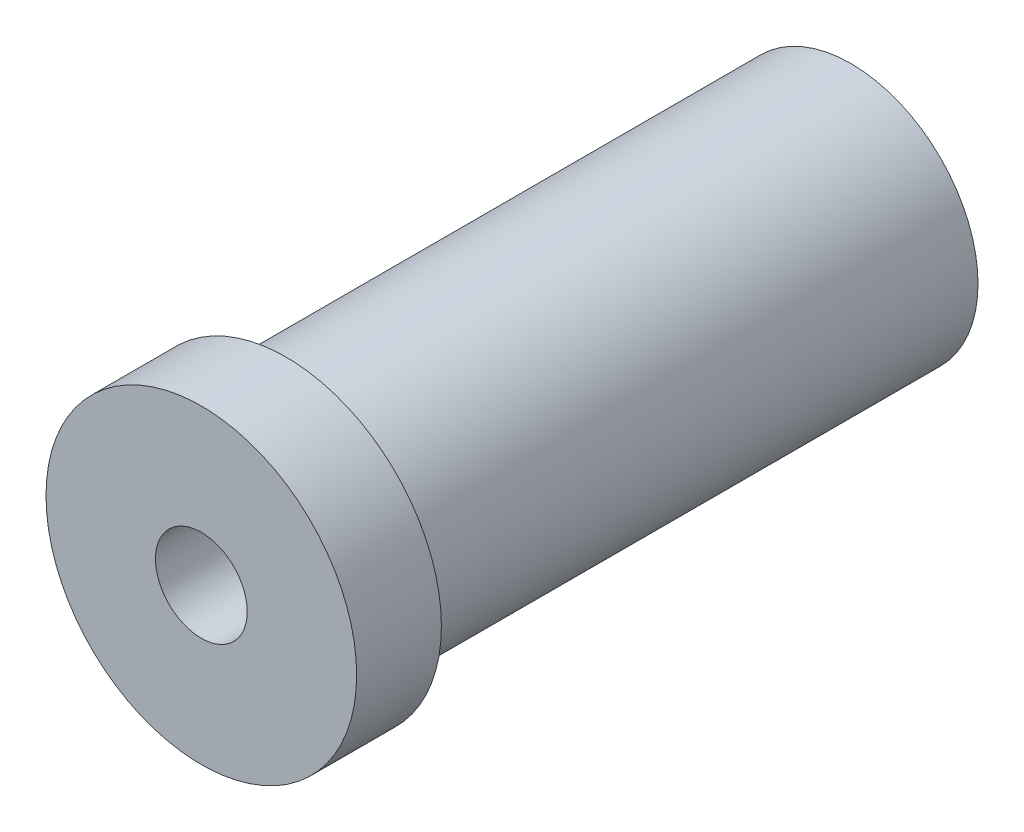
ISO-10303-21;
HEADER;
FILE_DESCRIPTION(('STEP AP214'),'2;1');
FILE_NAME('part.step','',(''),(''),'','','');
FILE_SCHEMA(('AUTOMOTIVE_DESIGN { 1 0 10303 214 1 1 1 1 }'));
ENDSEC;
DATA;
#1=APPLICATION_CONTEXT('core data for automotive mechanical design processes');
#2=APPLICATION_PROTOCOL_DEFINITION('international standard','automotive_design',2000,#1);
#3=PRODUCT_CONTEXT('',#1,'mechanical');
#4=PRODUCT('Part','Part','',(#3));
#5=PRODUCT_RELATED_PRODUCT_CATEGORY('part','',(#4));
#6=PRODUCT_DEFINITION_FORMATION('','',#4);
#7=PRODUCT_DEFINITION_CONTEXT('part definition',#1,'design');
#8=PRODUCT_DEFINITION('design','',#6,#7);
#9=PRODUCT_DEFINITION_SHAPE('','',#8);
#10=(LENGTH_UNIT() NAMED_UNIT(*) SI_UNIT(.MILLI.,.METRE.));
#11=(NAMED_UNIT(*) PLANE_ANGLE_UNIT() SI_UNIT($,.RADIAN.));
#12=(NAMED_UNIT(*) SI_UNIT($,.STERADIAN.) SOLID_ANGLE_UNIT());
#13=UNCERTAINTY_MEASURE_WITH_UNIT(LENGTH_MEASURE(1.E-05),#10,'distance_accuracy_value','');
#14=(GEOMETRIC_REPRESENTATION_CONTEXT(3) GLOBAL_UNCERTAINTY_ASSIGNED_CONTEXT((#13)) GLOBAL_UNIT_ASSIGNED_CONTEXT((#10,
#11,#12)) REPRESENTATION_CONTEXT('',''));
#15=CARTESIAN_POINT('',(0.,0.,0.));
#16=DIRECTION('',(0.,0.,1.));
#17=DIRECTION('',(1.,0.,0.));
#18=AXIS2_PLACEMENT_3D('',#15,#16,#17);
#19=CARTESIAN_POINT('',(0.,0.,0.));
#20=DIRECTION('',(0.,0.,1.));
#21=DIRECTION('',(1.,0.,0.));
#22=AXIS2_PLACEMENT_3D('',#19,#20,#21);
#23=CYLINDRICAL_SURFACE('',#22,11.);
#24=CARTESIAN_POINT('',(0.,0.,0.));
#25=DIRECTION('',(0.,0.,1.));
#26=DIRECTION('',(1.,0.,0.));
#27=AXIS2_PLACEMENT_3D('',#24,#25,#26);
#28=CIRCLE('',#27,11.);
#29=CARTESIAN_POINT('',(11.,0.,0.));
#30=VERTEX_POINT('',#29);
#31=EDGE_CURVE('E74',#30,#30,#28,.T.);
#32=ORIENTED_EDGE('',*,*,#31,.F.);
#33=EDGE_LOOP('',(#32));
#34=FACE_BOUND('',#33,.T.);
#35=CARTESIAN_POINT('',(0.,0.,-6.));
#36=DIRECTION('',(0.,0.,1.));
#37=DIRECTION('',(1.,0.,0.));
#38=AXIS2_PLACEMENT_3D('',#35,#36,#37);
#39=CIRCLE('',#38,11.);
#40=CARTESIAN_POINT('',(11.,0.,-6.));
#41=VERTEX_POINT('',#40);
#42=EDGE_CURVE('E77',#41,#41,#39,.T.);
#43=ORIENTED_EDGE('',*,*,#42,.T.);
#44=EDGE_LOOP('',(#43));
#45=FACE_BOUND('',#44,.T.);
#46=CARTESIAN_POINT('',(-11.,0.,-1.));
#47=CARTESIAN_POINT('',(-10.9999980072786,0.111357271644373,-1.00000431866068));
#48=CARTESIAN_POINT('',(-10.9982915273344,0.222771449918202,-1.00933175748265));
#49=CARTESIAN_POINT('',(-10.99164847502,0.442464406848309,-1.04637346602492));
#50=CARTESIAN_POINT('',(-10.9867091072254,0.550740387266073,-1.07410364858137));
#51=CARTESIAN_POINT('',(-10.9741532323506,0.760947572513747,-1.14707712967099));
#52=CARTESIAN_POINT('',(-10.9665390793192,0.862884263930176,-1.19230503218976));
#53=CARTESIAN_POINT('',(-10.949466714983,1.0577120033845,-1.29894733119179));
#54=CARTESIAN_POINT('',(-10.9400086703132,1.15060386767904,-1.36036026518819));
#55=CARTESIAN_POINT('',(-10.9201743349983,1.32576444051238,-1.4983659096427));
#56=CARTESIAN_POINT('',(-10.9097897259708,1.40791622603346,-1.57510584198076));
#57=CARTESIAN_POINT('',(-10.8893349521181,1.55825357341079,-1.74127035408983));
#58=CARTESIAN_POINT('',(-10.8792648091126,1.62643816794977,-1.83069581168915));
#59=CARTESIAN_POINT('',(-10.8604984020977,1.74738695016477,-2.02051272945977));
#60=CARTESIAN_POINT('',(-10.851812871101,1.80003313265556,-2.12098053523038));
#61=CARTESIAN_POINT('',(-10.836915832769,1.88765546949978,-2.32951865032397));
#62=CARTESIAN_POINT('',(-10.8307041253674,1.92263305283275,-2.43758834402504));
#63=CARTESIAN_POINT('',(-10.821541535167,1.97355197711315,-2.6570146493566));
#64=CARTESIAN_POINT('',(-10.8185558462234,1.98969666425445,-2.76832259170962));
#65=CARTESIAN_POINT('',(-10.8160783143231,2.00312248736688,-2.99210440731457));
#66=CARTESIAN_POINT('',(-10.8165861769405,2.00040521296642,-3.10457818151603));
#67=CARTESIAN_POINT('',(-10.8210066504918,1.97634934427,-3.32603191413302));
#68=CARTESIAN_POINT('',(-10.8248771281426,1.95524117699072,-3.43503786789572));
#69=CARTESIAN_POINT('',(-10.8355206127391,1.89536523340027,-3.64793501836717));
#70=CARTESIAN_POINT('',(-10.8422937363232,1.85659674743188,-3.75182600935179));
#71=CARTESIAN_POINT('',(-10.8580238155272,1.76227297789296,-3.95222279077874));
#72=CARTESIAN_POINT('',(-10.8669929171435,1.7066239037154,-4.04868344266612));
#73=CARTESIAN_POINT('',(-10.8860962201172,1.58018503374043,-4.23098473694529));
#74=CARTESIAN_POINT('',(-10.8962305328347,1.50939379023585,-4.31682436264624));
#75=CARTESIAN_POINT('',(-10.9167064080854,1.35343399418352,-4.47677899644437));
#76=CARTESIAN_POINT('',(-10.9270488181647,1.2680681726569,-4.55070168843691));
#77=CARTESIAN_POINT('',(-10.9466375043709,1.08604454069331,-4.68320513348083));
#78=CARTESIAN_POINT('',(-10.9558837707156,0.989386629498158,-4.74178574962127));
#79=CARTESIAN_POINT('',(-10.9722553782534,0.787327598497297,-4.84196738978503));
#80=CARTESIAN_POINT('',(-10.9793783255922,0.681916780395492,-4.88354926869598));
#81=CARTESIAN_POINT('',(-10.9906820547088,0.465448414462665,-4.9483631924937));
#82=CARTESIAN_POINT('',(-10.994863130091,0.354391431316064,-4.97159706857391));
#83=CARTESIAN_POINT('',(-10.9997719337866,0.131438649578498,-4.99878976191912));
#84=CARTESIAN_POINT('',(-11.0005468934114,0.019576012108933,-5.00301222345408));
#85=CARTESIAN_POINT('',(-10.998686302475,-0.203257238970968,-4.99276820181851));
#86=CARTESIAN_POINT('',(-10.9960509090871,-0.314227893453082,-4.97830257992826));
#87=CARTESIAN_POINT('',(-10.9876950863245,-0.531297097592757,-4.93131225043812));
#88=CARTESIAN_POINT('',(-10.9819973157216,-0.637425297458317,-4.89892013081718));
#89=CARTESIAN_POINT('',(-10.9681529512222,-0.84274471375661,-4.81713917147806));
#90=CARTESIAN_POINT('',(-10.9600061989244,-0.941935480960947,-4.7677492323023));
#91=CARTESIAN_POINT('',(-10.9420497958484,-1.13169524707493,-4.65278536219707));
#92=CARTESIAN_POINT('',(-10.932223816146,-1.22216445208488,-4.58704931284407));
#93=CARTESIAN_POINT('',(-10.9120428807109,-1.39088213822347,-4.44147962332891));
#94=CARTESIAN_POINT('',(-10.9016878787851,-1.46912954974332,-4.36164475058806));
#95=CARTESIAN_POINT('',(-10.8814603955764,-1.6121773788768,-4.18895311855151));
#96=CARTESIAN_POINT('',(-10.8715955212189,-1.67679836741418,-4.09594669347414));
#97=CARTESIAN_POINT('',(-10.8536151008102,-1.78949986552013,-3.90024381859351));
#98=CARTESIAN_POINT('',(-10.8454994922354,-1.83758096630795,-3.79754771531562));
#99=CARTESIAN_POINT('',(-10.8319954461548,-1.91557945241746,-3.58584925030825));
#100=CARTESIAN_POINT('',(-10.8265943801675,-1.9455810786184,-3.47687876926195));
#101=CARTESIAN_POINT('',(-10.8191012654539,-1.98683040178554,-3.25533701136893));
#102=CARTESIAN_POINT('',(-10.8170088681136,-1.99808007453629,-3.14276611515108));
#103=CARTESIAN_POINT('',(-10.8163869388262,-2.00144313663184,-2.91901462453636));
#104=CARTESIAN_POINT('',(-10.8178047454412,-1.99383937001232,-2.80783832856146));
#105=CARTESIAN_POINT('',(-10.8239270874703,-1.96032846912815,-2.58837636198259));
#106=CARTESIAN_POINT('',(-10.8286316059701,-1.93442142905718,-2.48009067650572));
#107=CARTESIAN_POINT('',(-10.8407757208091,-1.86515567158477,-2.26962380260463));
#108=CARTESIAN_POINT('',(-10.8482107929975,-1.82182581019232,-2.16743283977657));
#109=CARTESIAN_POINT('',(-10.8649817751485,-1.71897473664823,-1.97172555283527));
#110=CARTESIAN_POINT('',(-10.8743178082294,-1.65945247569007,-1.87820979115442));
#111=CARTESIAN_POINT('',(-10.8940032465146,-1.52491543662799,-1.70108712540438));
#112=CARTESIAN_POINT('',(-10.9043650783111,-1.44969415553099,-1.61763843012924));
#113=CARTESIAN_POINT('',(-10.9248399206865,-1.28632651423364,-1.46445291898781));
#114=CARTESIAN_POINT('',(-10.9349528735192,-1.19817718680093,-1.39471925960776));
#115=CARTESIAN_POINT('',(-10.9538897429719,-1.0105711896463,-1.27039970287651));
#116=CARTESIAN_POINT('',(-10.9627021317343,-0.911025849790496,-1.21594581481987));
#117=CARTESIAN_POINT('',(-10.9779326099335,-0.704073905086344,-1.12462078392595));
#118=CARTESIAN_POINT('',(-10.9843529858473,-0.59667492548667,-1.08773284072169));
#119=CARTESIAN_POINT('',(-10.9927407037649,-0.407441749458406,-1.04022456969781));
#120=CARTESIAN_POINT('',(-10.9954478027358,-0.32672542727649,-1.02516566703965));
#121=CARTESIAN_POINT('',(-10.9990781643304,-0.164016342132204,-1.0050519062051));
#122=CARTESIAN_POINT('',(-11.0000014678,-0.0820236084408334,-0.99999681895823));
#123=CARTESIAN_POINT('',(-11.,0.,-1.));
#124=B_SPLINE_CURVE_WITH_KNOTS('',3,(#46,#47,#48,#49,#50,#51,#52,#53,#54,#55,#56,#57,#58,#59,
#60,#61,#62,#63,#64,#65,#66,#67,#68,#69,#70,#71,#72,#73,#74,#75,#76,#77,#78,#79,#80,#81,#82,#83,
#84,#85,#86,#87,#88,#89,#90,#91,#92,#93,#94,#95,#96,#97,#98,#99,#100,#101,#102,#103,#104,#105,
#106,#107,#108,#109,#110,#111,#112,#113,#114,#115,#116,#117,#118,#119,#120,#121,#122,#123),
.UNSPECIFIED.,.T.,.F.,(4,2,2,2,2,2,2,2,2,2,2,2,2,2,2,2,2,2,2,2,2,2,2,2,2,2,2,2,2,2,2,2,2,2,2,2,
2,2,4),(0.,0.333771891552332,0.66783277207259,1.00160038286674,1.3353378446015,1.67245014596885,
2.00958578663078,2.3492195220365,2.6888257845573,3.02473021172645,3.36060633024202,
3.69233367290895,4.02407434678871,4.35769306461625,4.69134369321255,5.02993210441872,
5.36852353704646,5.70749527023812,6.04643316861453,6.38065600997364,6.71486344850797,
7.0466314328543,7.37842088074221,7.71364226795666,8.04889297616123,8.38831506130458,
8.72772501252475,9.06554101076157,9.40332141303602,9.73606509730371,10.0688070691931,
10.4010002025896,10.733214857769,11.0701111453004,11.4070848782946,11.7468860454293,
12.0863615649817,12.3322171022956,12.5780670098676),.UNSPECIFIED.);
#125=CARTESIAN_POINT('',(-11.,0.,-1.));
#126=VERTEX_POINT('',#125);
#127=EDGE_CURVE('E10',#126,#126,#124,.T.);
#128=ORIENTED_EDGE('',*,*,#127,.F.);
#129=EDGE_LOOP('',(#128));
#130=FACE_BOUND('',#129,.T.);
#131=ADVANCED_FACE('F16',(#34,#45,#130),#23,.T.);
#132=CARTESIAN_POINT('',(0.,3.25,-18.));
#133=DIRECTION('',(0.,0.,-1.));
#134=DIRECTION('',(-1.,0.,0.));
#135=AXIS2_PLACEMENT_3D('',#132,#133,#134);
#136=PLANE('',#135);
#137=CARTESIAN_POINT('',(0.,0.,-18.));
#138=DIRECTION('',(0.,0.,1.));
#139=DIRECTION('',(1.,0.,0.));
#140=AXIS2_PLACEMENT_3D('',#137,#138,#139);
#141=CIRCLE('',#140,3.);
#142=CARTESIAN_POINT('',(3.,0.,-18.));
#143=VERTEX_POINT('',#142);
#144=EDGE_CURVE('E100',#143,#143,#141,.T.);
#145=ORIENTED_EDGE('',*,*,#144,.F.);
#146=EDGE_LOOP('',(#145));
#147=FACE_BOUND('',#146,.T.);
#148=CARTESIAN_POINT('',(0.,0.,-18.));
#149=DIRECTION('',(0.,0.,1.));
#150=DIRECTION('',(1.,0.,0.));
#151=AXIS2_PLACEMENT_3D('',#148,#149,#150);
#152=CIRCLE('',#151,3.25);
#153=CARTESIAN_POINT('',(3.25,0.,-18.));
#154=VERTEX_POINT('',#153);
#155=EDGE_CURVE('E28',#154,#154,#152,.T.);
#156=ORIENTED_EDGE('',*,*,#155,.T.);
#157=EDGE_LOOP('',(#156));
#158=FACE_BOUND('',#157,.T.);
#159=ADVANCED_FACE('F18',(#147,#158),#136,.F.);
#160=CARTESIAN_POINT('',(0.,0.,0.));
#161=DIRECTION('',(0.,0.,1.));
#162=DIRECTION('',(1.,0.,0.));
#163=AXIS2_PLACEMENT_3D('',#160,#161,#162);
#164=CYLINDRICAL_SURFACE('',#163,3.25);
#165=ORIENTED_EDGE('',*,*,#155,.F.);
#166=EDGE_LOOP('',(#165));
#167=FACE_BOUND('',#166,.T.);
#168=CARTESIAN_POINT('',(0.,0.,0.));
#169=DIRECTION('',(0.,0.,1.));
#170=DIRECTION('',(1.,0.,0.));
#171=AXIS2_PLACEMENT_3D('',#168,#169,#170);
#172=CIRCLE('',#171,3.25);
#173=CARTESIAN_POINT('',(3.25,0.,0.));
#174=VERTEX_POINT('',#173);
#175=EDGE_CURVE('E73',#174,#174,#172,.T.);
#176=ORIENTED_EDGE('',*,*,#175,.T.);
#177=EDGE_LOOP('',(#176));
#178=FACE_BOUND('',#177,.T.);
#179=ADVANCED_FACE('F51',(#167,#178),#164,.F.);
#180=CARTESIAN_POINT('',(0.,3.25,0.));
#181=DIRECTION('',(0.,0.,-1.));
#182=DIRECTION('',(-1.,0.,0.));
#183=AXIS2_PLACEMENT_3D('',#180,#181,#182);
#184=PLANE('',#183);
#185=ORIENTED_EDGE('',*,*,#175,.F.);
#186=EDGE_LOOP('',(#185));
#187=FACE_BOUND('',#186,.T.);
#188=ORIENTED_EDGE('',*,*,#31,.T.);
#189=EDGE_LOOP('',(#188));
#190=FACE_BOUND('',#189,.T.);
#191=ADVANCED_FACE('F60',(#187,#190),#184,.F.);
#192=CARTESIAN_POINT('',(0.,11.,-6.));
#193=DIRECTION('',(0.,0.,1.));
#194=DIRECTION('',(1.,0.,0.));
#195=AXIS2_PLACEMENT_3D('',#192,#193,#194);
#196=PLANE('',#195);
#197=ORIENTED_EDGE('',*,*,#42,.F.);
#198=EDGE_LOOP('',(#197));
#199=FACE_BOUND('',#198,.T.);
#200=CARTESIAN_POINT('',(0.,0.,-6.));
#201=DIRECTION('',(0.,0.,1.));
#202=DIRECTION('',(1.,0.,0.));
#203=AXIS2_PLACEMENT_3D('',#200,#201,#202);
#204=CIRCLE('',#203,9.);
#205=CARTESIAN_POINT('',(9.,0.,-6.));
#206=VERTEX_POINT('',#205);
#207=EDGE_CURVE('E82',#206,#206,#204,.T.);
#208=ORIENTED_EDGE('',*,*,#207,.T.);
#209=EDGE_LOOP('',(#208));
#210=FACE_BOUND('',#209,.T.);
#211=ADVANCED_FACE('F58',(#199,#210),#196,.F.);
#212=CARTESIAN_POINT('',(0.,0.,0.));
#213=DIRECTION('',(0.,0.,1.));
#214=DIRECTION('',(1.,0.,0.));
#215=AXIS2_PLACEMENT_3D('',#212,#213,#214);
#216=CYLINDRICAL_SURFACE('',#215,9.);
#217=ORIENTED_EDGE('',*,*,#207,.F.);
#218=EDGE_LOOP('',(#217));
#219=FACE_BOUND('',#218,.T.);
#220=CARTESIAN_POINT('',(0.,0.,-46.));
#221=DIRECTION('',(0.,0.,1.));
#222=DIRECTION('',(1.,0.,0.));
#223=AXIS2_PLACEMENT_3D('',#220,#221,#222);
#224=CIRCLE('',#223,9.);
#225=CARTESIAN_POINT('',(9.,0.,-46.));
#226=VERTEX_POINT('',#225);
#227=EDGE_CURVE('E85',#226,#226,#224,.T.);
#228=ORIENTED_EDGE('',*,*,#227,.T.);
#229=EDGE_LOOP('',(#228));
#230=FACE_BOUND('',#229,.T.);
#231=ADVANCED_FACE('F132',(#219,#230),#216,.T.);
#232=CARTESIAN_POINT('',(0.,9.,-46.));
#233=DIRECTION('',(0.,0.,1.));
#234=DIRECTION('',(1.,0.,0.));
#235=AXIS2_PLACEMENT_3D('',#232,#233,#234);
#236=PLANE('',#235);
#237=ORIENTED_EDGE('',*,*,#227,.F.);
#238=EDGE_LOOP('',(#237));
#239=FACE_BOUND('',#238,.T.);
#240=CARTESIAN_POINT('',(0.,0.,-46.));
#241=DIRECTION('',(0.,0.,1.));
#242=DIRECTION('',(1.,0.,0.));
#243=AXIS2_PLACEMENT_3D('',#240,#241,#242);
#244=CIRCLE('',#243,3.1);
#245=CARTESIAN_POINT('',(3.1,0.,-46.));
#246=VERTEX_POINT('',#245);
#247=EDGE_CURVE('E88',#246,#246,#244,.T.);
#248=ORIENTED_EDGE('',*,*,#247,.T.);
#249=EDGE_LOOP('',(#248));
#250=FACE_BOUND('',#249,.T.);
#251=ADVANCED_FACE('F129',(#239,#250),#236,.F.);
#252=CARTESIAN_POINT('',(0.,0.,0.));
#253=DIRECTION('',(0.,0.,1.));
#254=DIRECTION('',(1.,0.,0.));
#255=AXIS2_PLACEMENT_3D('',#252,#253,#254);
#256=CYLINDRICAL_SURFACE('',#255,3.1);
#257=ORIENTED_EDGE('',*,*,#247,.F.);
#258=EDGE_LOOP('',(#257));
#259=FACE_BOUND('',#258,.T.);
#260=CARTESIAN_POINT('',(0.,0.,-44.));
#261=DIRECTION('',(0.,0.,1.));
#262=DIRECTION('',(1.,0.,0.));
#263=AXIS2_PLACEMENT_3D('',#260,#261,#262);
#264=CIRCLE('',#263,3.1);
#265=CARTESIAN_POINT('',(3.1,0.,-44.));
#266=VERTEX_POINT('',#265);
#267=EDGE_CURVE('E91',#266,#266,#264,.T.);
#268=ORIENTED_EDGE('',*,*,#267,.T.);
#269=EDGE_LOOP('',(#268));
#270=FACE_BOUND('',#269,.T.);
#271=ADVANCED_FACE('F125',(#259,#270),#256,.F.);
#272=CARTESIAN_POINT('',(0.,0.,-39.));
#273=DIRECTION('',(0.,0.,1.));
#274=DIRECTION('',(1.,0.,0.));
#275=AXIS2_PLACEMENT_3D('',#272,#273,#274);
#276=CONICAL_SURFACE('',#275,3.53744331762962,0.0872664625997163);
#277=ORIENTED_EDGE('',*,*,#267,.F.);
#278=EDGE_LOOP('',(#277));
#279=FACE_BOUND('',#278,.T.);
#280=CARTESIAN_POINT('',(0.,0.,-39.));
#281=DIRECTION('',(0.,0.,1.));
#282=DIRECTION('',(1.,0.,0.));
#283=AXIS2_PLACEMENT_3D('',#280,#281,#282);
#284=CIRCLE('',#283,3.53744331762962);
#285=CARTESIAN_POINT('',(3.53744331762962,0.,-39.));
#286=VERTEX_POINT('',#285);
#287=EDGE_CURVE('E94',#286,#286,#284,.T.);
#288=ORIENTED_EDGE('',*,*,#287,.T.);
#289=EDGE_LOOP('',(#288));
#290=FACE_BOUND('',#289,.T.);
#291=ADVANCED_FACE('F118',(#279,#290),#276,.F.);
#292=CARTESIAN_POINT('',(0.,3.53744331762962,-39.));
#293=DIRECTION('',(0.,0.,1.));
#294=DIRECTION('',(1.,0.,0.));
#295=AXIS2_PLACEMENT_3D('',#292,#293,#294);
#296=PLANE('',#295);
#297=ORIENTED_EDGE('',*,*,#287,.F.);
#298=EDGE_LOOP('',(#297));
#299=FACE_BOUND('',#298,.T.);
#300=CARTESIAN_POINT('',(0.,0.,-39.));
#301=DIRECTION('',(0.,0.,1.));
#302=DIRECTION('',(1.,0.,0.));
#303=AXIS2_PLACEMENT_3D('',#300,#301,#302);
#304=CIRCLE('',#303,3.);
#305=CARTESIAN_POINT('',(3.,0.,-39.));
#306=VERTEX_POINT('',#305);
#307=EDGE_CURVE('E97',#306,#306,#304,.T.);
#308=ORIENTED_EDGE('',*,*,#307,.T.);
#309=EDGE_LOOP('',(#308));
#310=FACE_BOUND('',#309,.T.);
#311=ADVANCED_FACE('F112',(#299,#310),#296,.F.);
#312=CARTESIAN_POINT('',(0.,0.,0.));
#313=DIRECTION('',(0.,0.,1.));
#314=DIRECTION('',(1.,0.,0.));
#315=AXIS2_PLACEMENT_3D('',#312,#313,#314);
#316=CYLINDRICAL_SURFACE('',#315,3.);
#317=ORIENTED_EDGE('',*,*,#307,.F.);
#318=EDGE_LOOP('',(#317));
#319=FACE_BOUND('',#318,.T.);
#320=ORIENTED_EDGE('',*,*,#144,.T.);
#321=EDGE_LOOP('',(#320));
#322=FACE_BOUND('',#321,.T.);
#323=ADVANCED_FACE('F41',(#319,#322),#316,.F.);
#324=CARTESIAN_POINT('',(-11.,0.,-3.));
#325=DIRECTION('',(-1.,0.,0.));
#326=DIRECTION('',(0.,0.,1.));
#327=AXIS2_PLACEMENT_3D('',#324,#325,#326);
#328=CYLINDRICAL_SURFACE('',#327,2.);
#329=CARTESIAN_POINT('',(-6.5,0.,-3.));
#330=DIRECTION('',(-1.,0.,0.));
#331=DIRECTION('',(0.,0.,1.));
#332=AXIS2_PLACEMENT_3D('',#329,#330,#331);
#333=CIRCLE('',#332,2.);
#334=CARTESIAN_POINT('',(-6.5,0.,-1.));
#335=VERTEX_POINT('',#334);
#336=EDGE_CURVE('E103',#335,#335,#333,.T.);
#337=ORIENTED_EDGE('',*,*,#336,.F.);
#338=EDGE_LOOP('',(#337));
#339=FACE_BOUND('',#338,.T.);
#340=ORIENTED_EDGE('',*,*,#127,.T.);
#341=EDGE_LOOP('',(#340));
#342=FACE_BOUND('',#341,.T.);
#343=ADVANCED_FACE('F33',(#339,#342),#328,.F.);
#344=CARTESIAN_POINT('',(-5.34529946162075,0.,-3.));
#345=DIRECTION('',(-1.,0.,0.));
#346=DIRECTION('',(0.,0.,1.));
#347=AXIS2_PLACEMENT_3D('',#344,#345,#346);
#348=CONICAL_SURFACE('',#347,0.,1.0471975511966);
#349=ORIENTED_EDGE('',*,*,#336,.T.);
#350=EDGE_LOOP('',(#349));
#351=FACE_BOUND('',#350,.T.);
#352=CARTESIAN_POINT('',(-5.34529946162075,0.,-3.));
#353=VERTEX_POINT('',#352);
#354=VERTEX_LOOP('',#353);
#355=FACE_BOUND('',#354,.T.);
#356=ADVANCED_FACE('F31',(#351,#355),#348,.F.);
#357=CLOSED_SHELL('',(#131,#159,#179,#191,#211,#231,#251,#271,#291,#311,#323,#343,#356));
#358=MANIFOLD_SOLID_BREP('B1',#357);
#359=ADVANCED_BREP_SHAPE_REPRESENTATION('',(#18,#358),#14);
#360=SHAPE_DEFINITION_REPRESENTATION(#9,#359);
ENDSEC;
END-ISO-10303-21;
